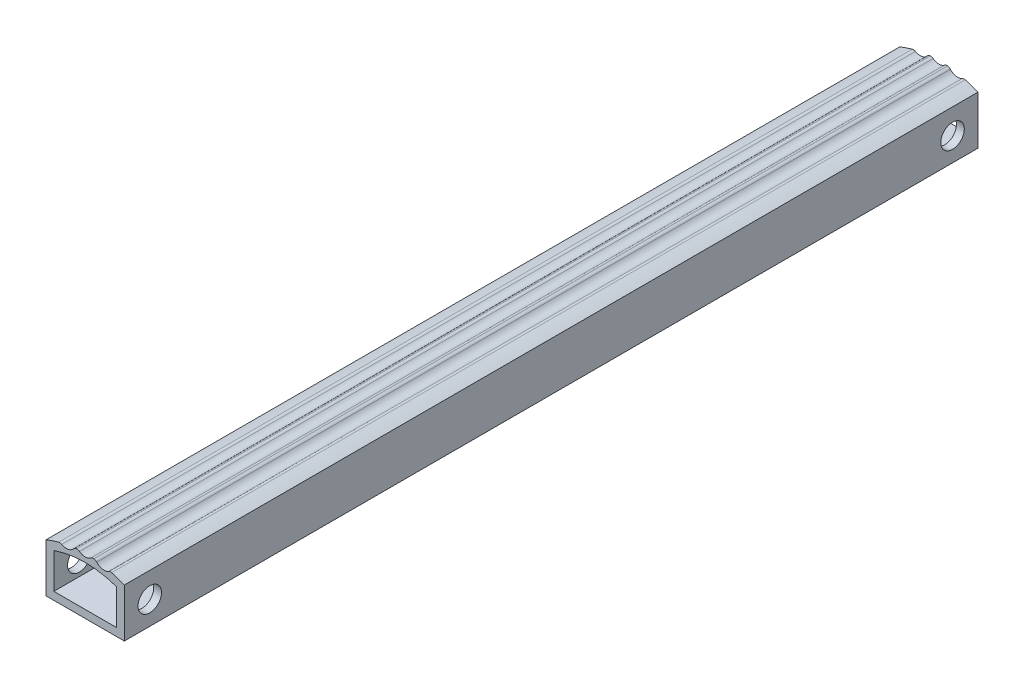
ISO-10303-21;
HEADER;
FILE_DESCRIPTION(('STEP AP214'),'2;1');
FILE_NAME('part.step','',(''),(''),'','','');
FILE_SCHEMA(('AUTOMOTIVE_DESIGN { 1 0 10303 214 1 1 1 1 }'));
ENDSEC;
DATA;
#1=APPLICATION_CONTEXT('core data for automotive mechanical design processes');
#2=APPLICATION_PROTOCOL_DEFINITION('international standard','automotive_design',2000,#1);
#3=PRODUCT_CONTEXT('',#1,'mechanical');
#4=PRODUCT('Part','Part','',(#3));
#5=PRODUCT_RELATED_PRODUCT_CATEGORY('part','',(#4));
#6=PRODUCT_DEFINITION_FORMATION('','',#4);
#7=PRODUCT_DEFINITION_CONTEXT('part definition',#1,'design');
#8=PRODUCT_DEFINITION('design','',#6,#7);
#9=PRODUCT_DEFINITION_SHAPE('','',#8);
#10=(LENGTH_UNIT() NAMED_UNIT(*) SI_UNIT(.MILLI.,.METRE.));
#11=(NAMED_UNIT(*) PLANE_ANGLE_UNIT() SI_UNIT($,.RADIAN.));
#12=(NAMED_UNIT(*) SI_UNIT($,.STERADIAN.) SOLID_ANGLE_UNIT());
#13=UNCERTAINTY_MEASURE_WITH_UNIT(LENGTH_MEASURE(1.E-05),#10,'distance_accuracy_value','');
#14=(GEOMETRIC_REPRESENTATION_CONTEXT(3) GLOBAL_UNCERTAINTY_ASSIGNED_CONTEXT((#13)) GLOBAL_UNIT_ASSIGNED_CONTEXT((#10,
#11,#12)) REPRESENTATION_CONTEXT('',''));
#15=CARTESIAN_POINT('',(0.,0.,0.));
#16=DIRECTION('',(0.,0.,1.));
#17=DIRECTION('',(1.,0.,0.));
#18=AXIS2_PLACEMENT_3D('',#15,#16,#17);
#19=CARTESIAN_POINT('',(0.,-5.8,54.5));
#20=DIRECTION('',(0.,0.,1.));
#21=DIRECTION('',(1.,0.,0.));
#22=AXIS2_PLACEMENT_3D('',#19,#20,#21);
#23=PLANE('',#22);
#24=DIRECTION('',(0.,-1.,0.));
#25=VECTOR('',#24,1.);
#26=CARTESIAN_POINT('',(-5.,0.,54.5));
#27=LINE('',#26,#25);
#28=CARTESIAN_POINT('',(-5.,6.2,54.5));
#29=VERTEX_POINT('',#28);
#30=CARTESIAN_POINT('',(-5.,0.,54.5));
#31=VERTEX_POINT('',#30);
#32=EDGE_CURVE('E212',#29,#31,#27,.T.);
#33=ORIENTED_EDGE('',*,*,#32,.T.);
#34=DIRECTION('',(1.,0.,0.));
#35=VECTOR('',#34,1.);
#36=CARTESIAN_POINT('',(-5.,0.,54.5));
#37=LINE('',#36,#35);
#38=CARTESIAN_POINT('',(5.,0.,54.5));
#39=VERTEX_POINT('',#38);
#40=EDGE_CURVE('E215',#31,#39,#37,.T.);
#41=ORIENTED_EDGE('',*,*,#40,.T.);
#42=DIRECTION('',(0.,1.,0.));
#43=VECTOR('',#42,1.);
#44=CARTESIAN_POINT('',(5.,0.,54.5));
#45=LINE('',#44,#43);
#46=CARTESIAN_POINT('',(5.,6.2,54.5));
#47=VERTEX_POINT('',#46);
#48=EDGE_CURVE('E218',#39,#47,#45,.T.);
#49=ORIENTED_EDGE('',*,*,#48,.T.);
#50=CARTESIAN_POINT('',(0.,-5.8,54.5));
#51=DIRECTION('',(0.,0.,1.));
#52=DIRECTION('',(1.,0.,0.));
#53=AXIS2_PLACEMENT_3D('',#50,#51,#52);
#54=CIRCLE('',#53,13.);
#55=CARTESIAN_POINT('',(3.37851103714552,6.75331283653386,54.5));
#56=VERTEX_POINT('',#55);
#57=EDGE_CURVE('E220',#47,#56,#54,.T.);
#58=ORIENTED_EDGE('',*,*,#57,.T.);
#59=CARTESIAN_POINT('',(3.24856830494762,6.27049311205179,54.5));
#60=DIRECTION('',(0.,0.,1.));
#61=DIRECTION('',(-1.,0.,0.));
#62=AXIS2_PLACEMENT_3D('',#59,#60,#61);
#63=CIRCLE('',#62,0.5);
#64=CARTESIAN_POINT('',(2.99745317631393,6.70286007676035,54.5));
#65=VERTEX_POINT('',#64);
#66=EDGE_CURVE('E222',#56,#65,#63,.T.);
#67=ORIENTED_EDGE('',*,*,#66,.T.);
#68=CARTESIAN_POINT('',(2.39477686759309,7.74054079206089,54.5));
#69=DIRECTION('',(0.,0.,-1.));
#70=DIRECTION('',(1.,0.,0.));
#71=AXIS2_PLACEMENT_3D('',#68,#69,#70);
#72=CIRCLE('',#71,1.20000000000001);
#73=CARTESIAN_POINT('',(1.47274455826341,6.9725196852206,54.5));
#74=VERTEX_POINT('',#73);
#75=EDGE_CURVE('E224',#65,#74,#72,.T.);
#76=ORIENTED_EDGE('',*,*,#75,.T.);
#77=CARTESIAN_POINT('',(1.08856442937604,6.65251089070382,54.5));
#78=DIRECTION('',(0.,0.,1.));
#79=DIRECTION('',(1.,0.,0.));
#80=AXIS2_PLACEMENT_3D('',#77,#78,#79);
#81=CIRCLE('',#80,0.5);
#82=CARTESIAN_POINT('',(1.13210700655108,7.15061132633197,54.5));
#83=VERTEX_POINT('',#82);
#84=EDGE_CURVE('E226',#74,#83,#81,.T.);
#85=ORIENTED_EDGE('',*,*,#84,.T.);
#86=CARTESIAN_POINT('',(0.,-5.8,54.5));
#87=DIRECTION('',(0.,0.,1.));
#88=DIRECTION('',(1.,0.,0.));
#89=AXIS2_PLACEMENT_3D('',#86,#87,#88);
#90=CIRCLE('',#89,13.);
#91=CARTESIAN_POINT('',(1.08333169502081,7.15478260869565,54.5));
#92=VERTEX_POINT('',#91);
#93=EDGE_CURVE('E228',#83,#92,#90,.T.);
#94=ORIENTED_EDGE('',*,*,#93,.T.);
#95=CARTESIAN_POINT('',(1.04166509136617,6.65652173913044,54.5));
#96=DIRECTION('',(0.,0.,1.));
#97=DIRECTION('',(-1.,0.,0.));
#98=AXIS2_PLACEMENT_3D('',#95,#96,#97);
#99=CIRCLE('',#98,0.5);
#100=CARTESIAN_POINT('',(0.735293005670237,7.05166240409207,54.5));
#101=VERTEX_POINT('',#100);
#102=EDGE_CURVE('E230',#92,#101,#99,.T.);
#103=ORIENTED_EDGE('',*,*,#102,.T.);
#104=CARTESIAN_POINT('',(0.,8.,54.5));
#105=DIRECTION('',(0.,0.,-1.));
#106=DIRECTION('',(1.,0.,0.));
#107=AXIS2_PLACEMENT_3D('',#104,#105,#106);
#108=CIRCLE('',#107,1.2);
#109=CARTESIAN_POINT('',(-0.735293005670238,7.05166240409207,54.5));
#110=VERTEX_POINT('',#109);
#111=EDGE_CURVE('E232',#101,#110,#108,.T.);
#112=ORIENTED_EDGE('',*,*,#111,.T.);
#113=CARTESIAN_POINT('',(-1.04166509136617,6.65652173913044,54.5));
#114=DIRECTION('',(0.,0.,1.));
#115=DIRECTION('',(1.,0.,0.));
#116=AXIS2_PLACEMENT_3D('',#113,#114,#115);
#117=CIRCLE('',#116,0.5);
#118=CARTESIAN_POINT('',(-1.08333169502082,7.15478260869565,54.5));
#119=VERTEX_POINT('',#118);
#120=EDGE_CURVE('E234',#110,#119,#117,.T.);
#121=ORIENTED_EDGE('',*,*,#120,.T.);
#122=CARTESIAN_POINT('',(0.,-5.8,54.5));
#123=DIRECTION('',(0.,0.,1.));
#124=DIRECTION('',(1.,0.,0.));
#125=AXIS2_PLACEMENT_3D('',#122,#123,#124);
#126=CIRCLE('',#125,13.);
#127=CARTESIAN_POINT('',(-1.13210700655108,7.15061132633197,54.5));
#128=VERTEX_POINT('',#127);
#129=EDGE_CURVE('E236',#119,#128,#126,.T.);
#130=ORIENTED_EDGE('',*,*,#129,.T.);
#131=CARTESIAN_POINT('',(-1.08856442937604,6.65251089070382,54.5));
#132=DIRECTION('',(0.,0.,1.));
#133=DIRECTION('',(-1.,0.,0.));
#134=AXIS2_PLACEMENT_3D('',#131,#132,#133);
#135=CIRCLE('',#134,0.5);
#136=CARTESIAN_POINT('',(-1.47274455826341,6.9725196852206,54.5));
#137=VERTEX_POINT('',#136);
#138=EDGE_CURVE('E238',#128,#137,#135,.T.);
#139=ORIENTED_EDGE('',*,*,#138,.T.);
#140=CARTESIAN_POINT('',(-2.39477686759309,7.74054079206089,54.5));
#141=DIRECTION('',(0.,0.,-1.));
#142=DIRECTION('',(-1.,0.,0.));
#143=AXIS2_PLACEMENT_3D('',#140,#141,#142);
#144=CIRCLE('',#143,1.20000000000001);
#145=CARTESIAN_POINT('',(-2.99745317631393,6.70286007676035,54.5));
#146=VERTEX_POINT('',#145);
#147=EDGE_CURVE('E240',#137,#146,#144,.T.);
#148=ORIENTED_EDGE('',*,*,#147,.T.);
#149=CARTESIAN_POINT('',(-3.24856830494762,6.27049311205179,54.5));
#150=DIRECTION('',(0.,0.,1.));
#151=DIRECTION('',(1.,0.,0.));
#152=AXIS2_PLACEMENT_3D('',#149,#150,#151);
#153=CIRCLE('',#152,0.5);
#154=CARTESIAN_POINT('',(-3.37851103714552,6.75331283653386,54.5));
#155=VERTEX_POINT('',#154);
#156=EDGE_CURVE('E242',#146,#155,#153,.T.);
#157=ORIENTED_EDGE('',*,*,#156,.T.);
#158=CARTESIAN_POINT('',(0.,-5.8,54.5));
#159=DIRECTION('',(0.,0.,1.));
#160=DIRECTION('',(1.,0.,0.));
#161=AXIS2_PLACEMENT_3D('',#158,#159,#160);
#162=CIRCLE('',#161,13.);
#163=EDGE_CURVE('E244',#155,#29,#162,.T.);
#164=ORIENTED_EDGE('',*,*,#163,.T.);
#165=EDGE_LOOP('',(#33,#41,#49,#58,#67,#76,#85,#94,#103,#112,#121,#130,#139,#148,#157,#164));
#166=FACE_BOUND('',#165,.T.);
#167=DIRECTION('',(0.,1.,0.));
#168=VECTOR('',#167,1.);
#169=CARTESIAN_POINT('',(4.,1.,54.5));
#170=LINE('',#169,#168);
#171=CARTESIAN_POINT('',(4.,1.,54.5));
#172=VERTEX_POINT('',#171);
#173=CARTESIAN_POINT('',(4.,5.51370849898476,54.5));
#174=VERTEX_POINT('',#173);
#175=EDGE_CURVE('E182',#172,#174,#170,.T.);
#176=ORIENTED_EDGE('',*,*,#175,.F.);
#177=DIRECTION('',(1.,0.,0.));
#178=VECTOR('',#177,1.);
#179=CARTESIAN_POINT('',(-4.,1.,54.5));
#180=LINE('',#179,#178);
#181=CARTESIAN_POINT('',(-4.,1.,54.5));
#182=VERTEX_POINT('',#181);
#183=EDGE_CURVE('E174',#182,#172,#180,.T.);
#184=ORIENTED_EDGE('',*,*,#183,.F.);
#185=DIRECTION('',(0.,-1.,0.));
#186=VECTOR('',#185,1.);
#187=CARTESIAN_POINT('',(-4.,1.,54.5));
#188=LINE('',#187,#186);
#189=CARTESIAN_POINT('',(-4.,5.51370849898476,54.5));
#190=VERTEX_POINT('',#189);
#191=EDGE_CURVE('E196',#190,#182,#188,.T.);
#192=ORIENTED_EDGE('',*,*,#191,.F.);
#193=CARTESIAN_POINT('',(0.,-5.8,54.5));
#194=DIRECTION('',(0.,0.,1.));
#195=DIRECTION('',(1.,0.,0.));
#196=AXIS2_PLACEMENT_3D('',#193,#194,#195);
#197=CIRCLE('',#196,12.);
#198=EDGE_CURVE('E194',#174,#190,#197,.T.);
#199=ORIENTED_EDGE('',*,*,#198,.F.);
#200=EDGE_LOOP('',(#176,#184,#192,#199));
#201=FACE_BOUND('',#200,.T.);
#202=ADVANCED_FACE('F35',(#166,#201),#23,.T.);
#203=CARTESIAN_POINT('',(0.,-5.8,-54.5));
#204=DIRECTION('',(0.,0.,1.));
#205=DIRECTION('',(1.,0.,0.));
#206=AXIS2_PLACEMENT_3D('',#203,#204,#205);
#207=PLANE('',#206);
#208=DIRECTION('',(0.,-1.,0.));
#209=VECTOR('',#208,1.);
#210=CARTESIAN_POINT('',(-5.,0.,-54.5));
#211=LINE('',#210,#209);
#212=CARTESIAN_POINT('',(-5.,6.2,-54.5));
#213=VERTEX_POINT('',#212);
#214=CARTESIAN_POINT('',(-5.,0.,-54.5));
#215=VERTEX_POINT('',#214);
#216=EDGE_CURVE('E190',#213,#215,#211,.T.);
#217=ORIENTED_EDGE('',*,*,#216,.F.);
#218=CARTESIAN_POINT('',(0.,-5.8,-54.5));
#219=DIRECTION('',(0.,0.,1.));
#220=DIRECTION('',(1.,0.,0.));
#221=AXIS2_PLACEMENT_3D('',#218,#219,#220);
#222=CIRCLE('',#221,13.);
#223=CARTESIAN_POINT('',(-3.37851103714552,6.75331283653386,-54.5));
#224=VERTEX_POINT('',#223);
#225=EDGE_CURVE('E216',#224,#213,#222,.T.);
#226=ORIENTED_EDGE('',*,*,#225,.F.);
#227=CARTESIAN_POINT('',(-3.24856830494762,6.27049311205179,-54.5));
#228=DIRECTION('',(0.,0.,1.));
#229=DIRECTION('',(1.,0.,0.));
#230=AXIS2_PLACEMENT_3D('',#227,#228,#229);
#231=CIRCLE('',#230,0.5);
#232=CARTESIAN_POINT('',(-2.99745317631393,6.70286007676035,-54.5));
#233=VERTEX_POINT('',#232);
#234=EDGE_CURVE('E275',#233,#224,#231,.T.);
#235=ORIENTED_EDGE('',*,*,#234,.F.);
#236=CARTESIAN_POINT('',(-2.39477686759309,7.74054079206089,-54.5));
#237=DIRECTION('',(0.,0.,-1.));
#238=DIRECTION('',(-1.,0.,0.));
#239=AXIS2_PLACEMENT_3D('',#236,#237,#238);
#240=CIRCLE('',#239,1.20000000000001);
#241=CARTESIAN_POINT('',(-1.47274455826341,6.9725196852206,-54.5));
#242=VERTEX_POINT('',#241);
#243=EDGE_CURVE('E273',#242,#233,#240,.T.);
#244=ORIENTED_EDGE('',*,*,#243,.F.);
#245=CARTESIAN_POINT('',(-1.08856442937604,6.65251089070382,-54.5));
#246=DIRECTION('',(0.,0.,1.));
#247=DIRECTION('',(-1.,0.,0.));
#248=AXIS2_PLACEMENT_3D('',#245,#246,#247);
#249=CIRCLE('',#248,0.5);
#250=CARTESIAN_POINT('',(-1.13210700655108,7.15061132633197,-54.5));
#251=VERTEX_POINT('',#250);
#252=EDGE_CURVE('E271',#251,#242,#249,.T.);
#253=ORIENTED_EDGE('',*,*,#252,.F.);
#254=CARTESIAN_POINT('',(0.,-5.8,-54.5));
#255=DIRECTION('',(0.,0.,1.));
#256=DIRECTION('',(1.,0.,0.));
#257=AXIS2_PLACEMENT_3D('',#254,#255,#256);
#258=CIRCLE('',#257,13.);
#259=CARTESIAN_POINT('',(-1.08333169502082,7.15478260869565,-54.5));
#260=VERTEX_POINT('',#259);
#261=EDGE_CURVE('E269',#260,#251,#258,.T.);
#262=ORIENTED_EDGE('',*,*,#261,.F.);
#263=CARTESIAN_POINT('',(-1.04166509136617,6.65652173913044,-54.5));
#264=DIRECTION('',(0.,0.,1.));
#265=DIRECTION('',(1.,0.,0.));
#266=AXIS2_PLACEMENT_3D('',#263,#264,#265);
#267=CIRCLE('',#266,0.5);
#268=CARTESIAN_POINT('',(-0.735293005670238,7.05166240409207,-54.5));
#269=VERTEX_POINT('',#268);
#270=EDGE_CURVE('E267',#269,#260,#267,.T.);
#271=ORIENTED_EDGE('',*,*,#270,.F.);
#272=CARTESIAN_POINT('',(0.,8.,-54.5));
#273=DIRECTION('',(0.,0.,-1.));
#274=DIRECTION('',(1.,0.,0.));
#275=AXIS2_PLACEMENT_3D('',#272,#273,#274);
#276=CIRCLE('',#275,1.2);
#277=CARTESIAN_POINT('',(0.735293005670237,7.05166240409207,-54.5));
#278=VERTEX_POINT('',#277);
#279=EDGE_CURVE('E265',#278,#269,#276,.T.);
#280=ORIENTED_EDGE('',*,*,#279,.F.);
#281=CARTESIAN_POINT('',(1.04166509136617,6.65652173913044,-54.5));
#282=DIRECTION('',(0.,0.,1.));
#283=DIRECTION('',(-1.,0.,0.));
#284=AXIS2_PLACEMENT_3D('',#281,#282,#283);
#285=CIRCLE('',#284,0.5);
#286=CARTESIAN_POINT('',(1.08333169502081,7.15478260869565,-54.5));
#287=VERTEX_POINT('',#286);
#288=EDGE_CURVE('E263',#287,#278,#285,.T.);
#289=ORIENTED_EDGE('',*,*,#288,.F.);
#290=CARTESIAN_POINT('',(0.,-5.8,-54.5));
#291=DIRECTION('',(0.,0.,1.));
#292=DIRECTION('',(1.,0.,0.));
#293=AXIS2_PLACEMENT_3D('',#290,#291,#292);
#294=CIRCLE('',#293,13.);
#295=CARTESIAN_POINT('',(1.13210700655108,7.15061132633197,-54.5));
#296=VERTEX_POINT('',#295);
#297=EDGE_CURVE('E261',#296,#287,#294,.T.);
#298=ORIENTED_EDGE('',*,*,#297,.F.);
#299=CARTESIAN_POINT('',(1.08856442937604,6.65251089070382,-54.5));
#300=DIRECTION('',(0.,0.,1.));
#301=DIRECTION('',(1.,0.,0.));
#302=AXIS2_PLACEMENT_3D('',#299,#300,#301);
#303=CIRCLE('',#302,0.5);
#304=CARTESIAN_POINT('',(1.47274455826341,6.9725196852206,-54.5));
#305=VERTEX_POINT('',#304);
#306=EDGE_CURVE('E259',#305,#296,#303,.T.);
#307=ORIENTED_EDGE('',*,*,#306,.F.);
#308=CARTESIAN_POINT('',(2.39477686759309,7.74054079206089,-54.5));
#309=DIRECTION('',(0.,0.,-1.));
#310=DIRECTION('',(1.,0.,0.));
#311=AXIS2_PLACEMENT_3D('',#308,#309,#310);
#312=CIRCLE('',#311,1.20000000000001);
#313=CARTESIAN_POINT('',(2.99745317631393,6.70286007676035,-54.5));
#314=VERTEX_POINT('',#313);
#315=EDGE_CURVE('E257',#314,#305,#312,.T.);
#316=ORIENTED_EDGE('',*,*,#315,.F.);
#317=CARTESIAN_POINT('',(3.24856830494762,6.27049311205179,-54.5));
#318=DIRECTION('',(0.,0.,1.));
#319=DIRECTION('',(-1.,0.,0.));
#320=AXIS2_PLACEMENT_3D('',#317,#318,#319);
#321=CIRCLE('',#320,0.5);
#322=CARTESIAN_POINT('',(3.37851103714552,6.75331283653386,-54.5));
#323=VERTEX_POINT('',#322);
#324=EDGE_CURVE('E255',#323,#314,#321,.T.);
#325=ORIENTED_EDGE('',*,*,#324,.F.);
#326=CARTESIAN_POINT('',(0.,-5.8,-54.5));
#327=DIRECTION('',(0.,0.,1.));
#328=DIRECTION('',(1.,0.,0.));
#329=AXIS2_PLACEMENT_3D('',#326,#327,#328);
#330=CIRCLE('',#329,13.);
#331=CARTESIAN_POINT('',(5.,6.2,-54.5));
#332=VERTEX_POINT('',#331);
#333=EDGE_CURVE('E253',#332,#323,#330,.T.);
#334=ORIENTED_EDGE('',*,*,#333,.F.);
#335=DIRECTION('',(0.,1.,0.));
#336=VECTOR('',#335,1.);
#337=CARTESIAN_POINT('',(5.,0.,-54.5));
#338=LINE('',#337,#336);
#339=CARTESIAN_POINT('',(5.,0.,-54.5));
#340=VERTEX_POINT('',#339);
#341=EDGE_CURVE('E251',#340,#332,#338,.T.);
#342=ORIENTED_EDGE('',*,*,#341,.F.);
#343=DIRECTION('',(1.,0.,0.));
#344=VECTOR('',#343,1.);
#345=CARTESIAN_POINT('',(-5.,0.,-54.5));
#346=LINE('',#345,#344);
#347=EDGE_CURVE('E249',#215,#340,#346,.T.);
#348=ORIENTED_EDGE('',*,*,#347,.F.);
#349=EDGE_LOOP('',(#217,#226,#235,#244,#253,#262,#271,#280,#289,#298,#307,#316,#325,#334,#342,#348));
#350=FACE_BOUND('',#349,.T.);
#351=DIRECTION('',(1.,0.,0.));
#352=VECTOR('',#351,1.);
#353=CARTESIAN_POINT('',(-4.,1.,-54.5));
#354=LINE('',#353,#352);
#355=CARTESIAN_POINT('',(-4.,1.,-54.5));
#356=VERTEX_POINT('',#355);
#357=CARTESIAN_POINT('',(4.,1.,-54.5));
#358=VERTEX_POINT('',#357);
#359=EDGE_CURVE('E60',#356,#358,#354,.T.);
#360=ORIENTED_EDGE('',*,*,#359,.T.);
#361=DIRECTION('',(0.,1.,0.));
#362=VECTOR('',#361,1.);
#363=CARTESIAN_POINT('',(4.,1.,-54.5));
#364=LINE('',#363,#362);
#365=CARTESIAN_POINT('',(4.,5.51370849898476,-54.5));
#366=VERTEX_POINT('',#365);
#367=EDGE_CURVE('E189',#358,#366,#364,.T.);
#368=ORIENTED_EDGE('',*,*,#367,.T.);
#369=CARTESIAN_POINT('',(0.,-5.8,-54.5));
#370=DIRECTION('',(0.,0.,1.));
#371=DIRECTION('',(1.,0.,0.));
#372=AXIS2_PLACEMENT_3D('',#369,#370,#371);
#373=CIRCLE('',#372,12.);
#374=CARTESIAN_POINT('',(-4.,5.51370849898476,-54.5));
#375=VERTEX_POINT('',#374);
#376=EDGE_CURVE('E204',#366,#375,#373,.T.);
#377=ORIENTED_EDGE('',*,*,#376,.T.);
#378=DIRECTION('',(0.,-1.,0.));
#379=VECTOR('',#378,1.);
#380=CARTESIAN_POINT('',(-4.,1.,-54.5));
#381=LINE('',#380,#379);
#382=EDGE_CURVE('E183',#375,#356,#381,.T.);
#383=ORIENTED_EDGE('',*,*,#382,.T.);
#384=EDGE_LOOP('',(#360,#368,#377,#383));
#385=FACE_BOUND('',#384,.T.);
#386=ADVANCED_FACE('F358',(#350,#385),#207,.F.);
#387=CARTESIAN_POINT('',(-5.,0.,54.5));
#388=DIRECTION('',(1.,0.,0.));
#389=DIRECTION('',(0.,0.,-1.));
#390=AXIS2_PLACEMENT_3D('',#387,#388,#389);
#391=PLANE('',#390);
#392=CARTESIAN_POINT('',(-5.,3.00000000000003,51.25));
#393=DIRECTION('',(-1.,0.,0.));
#394=DIRECTION('',(0.,0.,1.));
#395=AXIS2_PLACEMENT_3D('',#392,#393,#394);
#396=CIRCLE('',#395,1.5);
#397=CARTESIAN_POINT('',(-5.,3.00000000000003,52.75));
#398=VERTEX_POINT('',#397);
#399=EDGE_CURVE('E337',#398,#398,#396,.T.);
#400=ORIENTED_EDGE('',*,*,#399,.F.);
#401=EDGE_LOOP('',(#400));
#402=FACE_BOUND('',#401,.T.);
#403=CARTESIAN_POINT('',(-5.,3.,-51.25));
#404=DIRECTION('',(-1.,0.,0.));
#405=DIRECTION('',(0.,0.,1.));
#406=AXIS2_PLACEMENT_3D('',#403,#404,#405);
#407=CIRCLE('',#406,1.5);
#408=CARTESIAN_POINT('',(-5.,3.,-49.75));
#409=VERTEX_POINT('',#408);
#410=EDGE_CURVE('E327',#409,#409,#407,.T.);
#411=ORIENTED_EDGE('',*,*,#410,.F.);
#412=EDGE_LOOP('',(#411));
#413=FACE_BOUND('',#412,.T.);
#414=ORIENTED_EDGE('',*,*,#216,.T.);
#415=DIRECTION('',(0.,0.,-1.));
#416=VECTOR('',#415,1.);
#417=CARTESIAN_POINT('',(-5.,0.,54.5));
#418=LINE('',#417,#416);
#419=EDGE_CURVE('E11',#31,#215,#418,.T.);
#420=ORIENTED_EDGE('',*,*,#419,.F.);
#421=ORIENTED_EDGE('',*,*,#32,.F.);
#422=DIRECTION('',(0.,0.,-1.));
#423=VECTOR('',#422,1.);
#424=CARTESIAN_POINT('',(-5.,6.2,54.5));
#425=LINE('',#424,#423);
#426=EDGE_CURVE('E246',#29,#213,#425,.T.);
#427=ORIENTED_EDGE('',*,*,#426,.T.);
#428=EDGE_LOOP('',(#414,#420,#421,#427));
#429=FACE_BOUND('',#428,.T.);
#430=ADVANCED_FACE('F37',(#402,#413,#429),#391,.F.);
#431=CARTESIAN_POINT('',(-5.,0.,54.5));
#432=DIRECTION('',(0.,1.,0.));
#433=DIRECTION('',(0.,0.,1.));
#434=AXIS2_PLACEMENT_3D('',#431,#432,#433);
#435=PLANE('',#434);
#436=ORIENTED_EDGE('',*,*,#347,.T.);
#437=DIRECTION('',(0.,0.,-1.));
#438=VECTOR('',#437,1.);
#439=CARTESIAN_POINT('',(5.,0.,54.5));
#440=LINE('',#439,#438);
#441=EDGE_CURVE('E44',#39,#340,#440,.T.);
#442=ORIENTED_EDGE('',*,*,#441,.F.);
#443=ORIENTED_EDGE('',*,*,#40,.F.);
#444=ORIENTED_EDGE('',*,*,#419,.T.);
#445=EDGE_LOOP('',(#436,#442,#443,#444));
#446=FACE_BOUND('',#445,.T.);
#447=ADVANCED_FACE('F431',(#446),#435,.F.);
#448=CARTESIAN_POINT('',(5.,0.,54.5));
#449=DIRECTION('',(-1.,0.,0.));
#450=DIRECTION('',(0.,0.,1.));
#451=AXIS2_PLACEMENT_3D('',#448,#449,#450);
#452=PLANE('',#451);
#453=CARTESIAN_POINT('',(5.,3.00000000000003,51.25));
#454=DIRECTION('',(-1.,0.,0.));
#455=DIRECTION('',(0.,0.,1.));
#456=AXIS2_PLACEMENT_3D('',#453,#454,#455);
#457=CIRCLE('',#456,1.5);
#458=CARTESIAN_POINT('',(5.,3.00000000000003,52.75));
#459=VERTEX_POINT('',#458);
#460=EDGE_CURVE('E340',#459,#459,#457,.T.);
#461=ORIENTED_EDGE('',*,*,#460,.T.);
#462=EDGE_LOOP('',(#461));
#463=FACE_BOUND('',#462,.T.);
#464=CARTESIAN_POINT('',(5.,3.,-51.25));
#465=DIRECTION('',(-1.,0.,0.));
#466=DIRECTION('',(0.,0.,1.));
#467=AXIS2_PLACEMENT_3D('',#464,#465,#466);
#468=CIRCLE('',#467,1.5);
#469=CARTESIAN_POINT('',(5.,3.,-49.75));
#470=VERTEX_POINT('',#469);
#471=EDGE_CURVE('E322',#470,#470,#468,.T.);
#472=ORIENTED_EDGE('',*,*,#471,.T.);
#473=EDGE_LOOP('',(#472));
#474=FACE_BOUND('',#473,.T.);
#475=ORIENTED_EDGE('',*,*,#341,.T.);
#476=DIRECTION('',(0.,0.,-1.));
#477=VECTOR('',#476,1.);
#478=CARTESIAN_POINT('',(5.,6.2,54.5));
#479=LINE('',#478,#477);
#480=EDGE_CURVE('E316',#47,#332,#479,.T.);
#481=ORIENTED_EDGE('',*,*,#480,.F.);
#482=ORIENTED_EDGE('',*,*,#48,.F.);
#483=ORIENTED_EDGE('',*,*,#441,.T.);
#484=EDGE_LOOP('',(#475,#481,#482,#483));
#485=FACE_BOUND('',#484,.T.);
#486=ADVANCED_FACE('F428',(#463,#474,#485),#452,.F.);
#487=CARTESIAN_POINT('',(0.,-5.8,54.5));
#488=DIRECTION('',(0.,0.,-1.));
#489=DIRECTION('',(-1.,0.,0.));
#490=AXIS2_PLACEMENT_3D('',#487,#488,#489);
#491=CYLINDRICAL_SURFACE('',#490,13.);
#492=ORIENTED_EDGE('',*,*,#333,.T.);
#493=DIRECTION('',(0.,0.,-1.));
#494=VECTOR('',#493,1.);
#495=CARTESIAN_POINT('',(3.37851103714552,6.75331283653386,54.5));
#496=LINE('',#495,#494);
#497=EDGE_CURVE('E313',#56,#323,#496,.T.);
#498=ORIENTED_EDGE('',*,*,#497,.F.);
#499=ORIENTED_EDGE('',*,*,#57,.F.);
#500=ORIENTED_EDGE('',*,*,#480,.T.);
#501=EDGE_LOOP('',(#492,#498,#499,#500));
#502=FACE_BOUND('',#501,.T.);
#503=ADVANCED_FACE('F424',(#502),#491,.T.);
#504=CARTESIAN_POINT('',(3.24856830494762,6.27049311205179,54.5));
#505=DIRECTION('',(0.,0.,-1.));
#506=DIRECTION('',(-1.,0.,0.));
#507=AXIS2_PLACEMENT_3D('',#504,#505,#506);
#508=CYLINDRICAL_SURFACE('',#507,0.5);
#509=ORIENTED_EDGE('',*,*,#324,.T.);
#510=DIRECTION('',(0.,0.,-1.));
#511=VECTOR('',#510,1.);
#512=CARTESIAN_POINT('',(2.99745317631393,6.70286007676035,54.5));
#513=LINE('',#512,#511);
#514=EDGE_CURVE('E310',#65,#314,#513,.T.);
#515=ORIENTED_EDGE('',*,*,#514,.F.);
#516=ORIENTED_EDGE('',*,*,#66,.F.);
#517=ORIENTED_EDGE('',*,*,#497,.T.);
#518=EDGE_LOOP('',(#509,#515,#516,#517));
#519=FACE_BOUND('',#518,.T.);
#520=ADVANCED_FACE('F420',(#519),#508,.T.);
#521=CARTESIAN_POINT('',(2.39477686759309,7.74054079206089,54.5));
#522=DIRECTION('',(0.,0.,-1.));
#523=DIRECTION('',(-1.,0.,0.));
#524=AXIS2_PLACEMENT_3D('',#521,#522,#523);
#525=CYLINDRICAL_SURFACE('',#524,1.20000000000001);
#526=ORIENTED_EDGE('',*,*,#315,.T.);
#527=DIRECTION('',(0.,0.,-1.));
#528=VECTOR('',#527,1.);
#529=CARTESIAN_POINT('',(1.47274455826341,6.9725196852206,54.5));
#530=LINE('',#529,#528);
#531=EDGE_CURVE('E307',#74,#305,#530,.T.);
#532=ORIENTED_EDGE('',*,*,#531,.F.);
#533=ORIENTED_EDGE('',*,*,#75,.F.);
#534=ORIENTED_EDGE('',*,*,#514,.T.);
#535=EDGE_LOOP('',(#526,#532,#533,#534));
#536=FACE_BOUND('',#535,.T.);
#537=ADVANCED_FACE('F416',(#536),#525,.F.);
#538=CARTESIAN_POINT('',(1.08856442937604,6.65251089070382,54.5));
#539=DIRECTION('',(0.,0.,-1.));
#540=DIRECTION('',(-1.,0.,0.));
#541=AXIS2_PLACEMENT_3D('',#538,#539,#540);
#542=CYLINDRICAL_SURFACE('',#541,0.5);
#543=ORIENTED_EDGE('',*,*,#306,.T.);
#544=DIRECTION('',(0.,0.,-1.));
#545=VECTOR('',#544,1.);
#546=CARTESIAN_POINT('',(1.13210700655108,7.15061132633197,54.5));
#547=LINE('',#546,#545);
#548=EDGE_CURVE('E304',#83,#296,#547,.T.);
#549=ORIENTED_EDGE('',*,*,#548,.F.);
#550=ORIENTED_EDGE('',*,*,#84,.F.);
#551=ORIENTED_EDGE('',*,*,#531,.T.);
#552=EDGE_LOOP('',(#543,#549,#550,#551));
#553=FACE_BOUND('',#552,.T.);
#554=ADVANCED_FACE('F412',(#553),#542,.T.);
#555=CARTESIAN_POINT('',(0.,-5.8,54.5));
#556=DIRECTION('',(0.,0.,-1.));
#557=DIRECTION('',(-1.,0.,0.));
#558=AXIS2_PLACEMENT_3D('',#555,#556,#557);
#559=CYLINDRICAL_SURFACE('',#558,13.);
#560=ORIENTED_EDGE('',*,*,#297,.T.);
#561=DIRECTION('',(0.,0.,-1.));
#562=VECTOR('',#561,1.);
#563=CARTESIAN_POINT('',(1.08333169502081,7.15478260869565,54.5));
#564=LINE('',#563,#562);
#565=EDGE_CURVE('E301',#92,#287,#564,.T.);
#566=ORIENTED_EDGE('',*,*,#565,.F.);
#567=ORIENTED_EDGE('',*,*,#93,.F.);
#568=ORIENTED_EDGE('',*,*,#548,.T.);
#569=EDGE_LOOP('',(#560,#566,#567,#568));
#570=FACE_BOUND('',#569,.T.);
#571=ADVANCED_FACE('F408',(#570),#559,.T.);
#572=CARTESIAN_POINT('',(1.04166509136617,6.65652173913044,54.5));
#573=DIRECTION('',(0.,0.,-1.));
#574=DIRECTION('',(-1.,0.,0.));
#575=AXIS2_PLACEMENT_3D('',#572,#573,#574);
#576=CYLINDRICAL_SURFACE('',#575,0.5);
#577=ORIENTED_EDGE('',*,*,#288,.T.);
#578=DIRECTION('',(0.,0.,-1.));
#579=VECTOR('',#578,1.);
#580=CARTESIAN_POINT('',(0.735293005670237,7.05166240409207,54.5));
#581=LINE('',#580,#579);
#582=EDGE_CURVE('E298',#101,#278,#581,.T.);
#583=ORIENTED_EDGE('',*,*,#582,.F.);
#584=ORIENTED_EDGE('',*,*,#102,.F.);
#585=ORIENTED_EDGE('',*,*,#565,.T.);
#586=EDGE_LOOP('',(#577,#583,#584,#585));
#587=FACE_BOUND('',#586,.T.);
#588=ADVANCED_FACE('F404',(#587),#576,.T.);
#589=CARTESIAN_POINT('',(0.,8.,54.5));
#590=DIRECTION('',(0.,0.,-1.));
#591=DIRECTION('',(-1.,0.,0.));
#592=AXIS2_PLACEMENT_3D('',#589,#590,#591);
#593=CYLINDRICAL_SURFACE('',#592,1.2);
#594=ORIENTED_EDGE('',*,*,#279,.T.);
#595=DIRECTION('',(0.,0.,-1.));
#596=VECTOR('',#595,1.);
#597=CARTESIAN_POINT('',(-0.735293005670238,7.05166240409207,54.5));
#598=LINE('',#597,#596);
#599=EDGE_CURVE('E295',#110,#269,#598,.T.);
#600=ORIENTED_EDGE('',*,*,#599,.F.);
#601=ORIENTED_EDGE('',*,*,#111,.F.);
#602=ORIENTED_EDGE('',*,*,#582,.T.);
#603=EDGE_LOOP('',(#594,#600,#601,#602));
#604=FACE_BOUND('',#603,.T.);
#605=ADVANCED_FACE('F400',(#604),#593,.F.);
#606=CARTESIAN_POINT('',(-1.04166509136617,6.65652173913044,54.5));
#607=DIRECTION('',(0.,0.,-1.));
#608=DIRECTION('',(-1.,0.,0.));
#609=AXIS2_PLACEMENT_3D('',#606,#607,#608);
#610=CYLINDRICAL_SURFACE('',#609,0.5);
#611=ORIENTED_EDGE('',*,*,#270,.T.);
#612=DIRECTION('',(0.,0.,-1.));
#613=VECTOR('',#612,1.);
#614=CARTESIAN_POINT('',(-1.08333169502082,7.15478260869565,54.5));
#615=LINE('',#614,#613);
#616=EDGE_CURVE('E292',#119,#260,#615,.T.);
#617=ORIENTED_EDGE('',*,*,#616,.F.);
#618=ORIENTED_EDGE('',*,*,#120,.F.);
#619=ORIENTED_EDGE('',*,*,#599,.T.);
#620=EDGE_LOOP('',(#611,#617,#618,#619));
#621=FACE_BOUND('',#620,.T.);
#622=ADVANCED_FACE('F396',(#621),#610,.T.);
#623=CARTESIAN_POINT('',(0.,-5.8,54.5));
#624=DIRECTION('',(0.,0.,-1.));
#625=DIRECTION('',(-1.,0.,0.));
#626=AXIS2_PLACEMENT_3D('',#623,#624,#625);
#627=CYLINDRICAL_SURFACE('',#626,13.);
#628=ORIENTED_EDGE('',*,*,#261,.T.);
#629=DIRECTION('',(0.,0.,-1.));
#630=VECTOR('',#629,1.);
#631=CARTESIAN_POINT('',(-1.13210700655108,7.15061132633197,54.5));
#632=LINE('',#631,#630);
#633=EDGE_CURVE('E289',#128,#251,#632,.T.);
#634=ORIENTED_EDGE('',*,*,#633,.F.);
#635=ORIENTED_EDGE('',*,*,#129,.F.);
#636=ORIENTED_EDGE('',*,*,#616,.T.);
#637=EDGE_LOOP('',(#628,#634,#635,#636));
#638=FACE_BOUND('',#637,.T.);
#639=ADVANCED_FACE('F392',(#638),#627,.T.);
#640=CARTESIAN_POINT('',(-1.08856442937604,6.65251089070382,54.5));
#641=DIRECTION('',(0.,0.,-1.));
#642=DIRECTION('',(-1.,0.,0.));
#643=AXIS2_PLACEMENT_3D('',#640,#641,#642);
#644=CYLINDRICAL_SURFACE('',#643,0.5);
#645=ORIENTED_EDGE('',*,*,#252,.T.);
#646=DIRECTION('',(0.,0.,-1.));
#647=VECTOR('',#646,1.);
#648=CARTESIAN_POINT('',(-1.47274455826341,6.9725196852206,54.5));
#649=LINE('',#648,#647);
#650=EDGE_CURVE('E286',#137,#242,#649,.T.);
#651=ORIENTED_EDGE('',*,*,#650,.F.);
#652=ORIENTED_EDGE('',*,*,#138,.F.);
#653=ORIENTED_EDGE('',*,*,#633,.T.);
#654=EDGE_LOOP('',(#645,#651,#652,#653));
#655=FACE_BOUND('',#654,.T.);
#656=ADVANCED_FACE('F388',(#655),#644,.T.);
#657=CARTESIAN_POINT('',(-2.39477686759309,7.74054079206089,54.5));
#658=DIRECTION('',(0.,0.,-1.));
#659=DIRECTION('',(-1.,0.,0.));
#660=AXIS2_PLACEMENT_3D('',#657,#658,#659);
#661=CYLINDRICAL_SURFACE('',#660,1.20000000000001);
#662=ORIENTED_EDGE('',*,*,#243,.T.);
#663=DIRECTION('',(0.,0.,-1.));
#664=VECTOR('',#663,1.);
#665=CARTESIAN_POINT('',(-2.99745317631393,6.70286007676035,54.5));
#666=LINE('',#665,#664);
#667=EDGE_CURVE('E283',#146,#233,#666,.T.);
#668=ORIENTED_EDGE('',*,*,#667,.F.);
#669=ORIENTED_EDGE('',*,*,#147,.F.);
#670=ORIENTED_EDGE('',*,*,#650,.T.);
#671=EDGE_LOOP('',(#662,#668,#669,#670));
#672=FACE_BOUND('',#671,.T.);
#673=ADVANCED_FACE('F384',(#672),#661,.F.);
#674=CARTESIAN_POINT('',(-3.24856830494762,6.27049311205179,54.5));
#675=DIRECTION('',(0.,0.,-1.));
#676=DIRECTION('',(-1.,0.,0.));
#677=AXIS2_PLACEMENT_3D('',#674,#675,#676);
#678=CYLINDRICAL_SURFACE('',#677,0.5);
#679=ORIENTED_EDGE('',*,*,#234,.T.);
#680=DIRECTION('',(0.,0.,-1.));
#681=VECTOR('',#680,1.);
#682=CARTESIAN_POINT('',(-3.37851103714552,6.75331283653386,54.5));
#683=LINE('',#682,#681);
#684=EDGE_CURVE('E280',#155,#224,#683,.T.);
#685=ORIENTED_EDGE('',*,*,#684,.F.);
#686=ORIENTED_EDGE('',*,*,#156,.F.);
#687=ORIENTED_EDGE('',*,*,#667,.T.);
#688=EDGE_LOOP('',(#679,#685,#686,#687));
#689=FACE_BOUND('',#688,.T.);
#690=ADVANCED_FACE('F380',(#689),#678,.T.);
#691=CARTESIAN_POINT('',(0.,-5.8,54.5));
#692=DIRECTION('',(0.,0.,-1.));
#693=DIRECTION('',(-1.,0.,0.));
#694=AXIS2_PLACEMENT_3D('',#691,#692,#693);
#695=CYLINDRICAL_SURFACE('',#694,13.);
#696=ORIENTED_EDGE('',*,*,#225,.T.);
#697=ORIENTED_EDGE('',*,*,#426,.F.);
#698=ORIENTED_EDGE('',*,*,#163,.F.);
#699=ORIENTED_EDGE('',*,*,#684,.T.);
#700=EDGE_LOOP('',(#696,#697,#698,#699));
#701=FACE_BOUND('',#700,.T.);
#702=ADVANCED_FACE('F377',(#701),#695,.T.);
#703=CARTESIAN_POINT('',(-4.,1.,54.5));
#704=DIRECTION('',(0.,1.,0.));
#705=DIRECTION('',(0.,0.,1.));
#706=AXIS2_PLACEMENT_3D('',#703,#704,#705);
#707=PLANE('',#706);
#708=ORIENTED_EDGE('',*,*,#359,.F.);
#709=DIRECTION('',(0.,0.,-1.));
#710=VECTOR('',#709,1.);
#711=CARTESIAN_POINT('',(-4.,1.,54.5));
#712=LINE('',#711,#710);
#713=EDGE_CURVE('E178',#182,#356,#712,.T.);
#714=ORIENTED_EDGE('',*,*,#713,.F.);
#715=ORIENTED_EDGE('',*,*,#183,.T.);
#716=DIRECTION('',(0.,0.,-1.));
#717=VECTOR('',#716,1.);
#718=CARTESIAN_POINT('',(4.,1.,54.5));
#719=LINE('',#718,#717);
#720=EDGE_CURVE('E177',#172,#358,#719,.T.);
#721=ORIENTED_EDGE('',*,*,#720,.T.);
#722=EDGE_LOOP('',(#708,#714,#715,#721));
#723=FACE_BOUND('',#722,.T.);
#724=ADVANCED_FACE('F176',(#723),#707,.T.);
#725=CARTESIAN_POINT('',(4.,1.,54.5));
#726=DIRECTION('',(-1.,0.,0.));
#727=DIRECTION('',(0.,-1.,0.));
#728=AXIS2_PLACEMENT_3D('',#725,#726,#727);
#729=PLANE('',#728);
#730=CARTESIAN_POINT('',(4.,3.00000000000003,51.25));
#731=DIRECTION('',(-1.,0.,0.));
#732=DIRECTION('',(0.,-1.,0.));
#733=AXIS2_PLACEMENT_3D('',#730,#731,#732);
#734=CIRCLE('',#733,1.5);
#735=CARTESIAN_POINT('',(4.,1.50000000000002,51.25));
#736=VERTEX_POINT('',#735);
#737=EDGE_CURVE('E332',#736,#736,#734,.T.);
#738=ORIENTED_EDGE('',*,*,#737,.F.);
#739=EDGE_LOOP('',(#738));
#740=FACE_BOUND('',#739,.T.);
#741=CARTESIAN_POINT('',(4.,3.,-51.25));
#742=DIRECTION('',(-1.,0.,0.));
#743=DIRECTION('',(0.,-1.,0.));
#744=AXIS2_PLACEMENT_3D('',#741,#742,#743);
#745=CIRCLE('',#744,1.5);
#746=CARTESIAN_POINT('',(4.,1.5,-51.25));
#747=VERTEX_POINT('',#746);
#748=EDGE_CURVE('E202',#747,#747,#745,.T.);
#749=ORIENTED_EDGE('',*,*,#748,.F.);
#750=EDGE_LOOP('',(#749));
#751=FACE_BOUND('',#750,.T.);
#752=ORIENTED_EDGE('',*,*,#367,.F.);
#753=ORIENTED_EDGE('',*,*,#720,.F.);
#754=ORIENTED_EDGE('',*,*,#175,.T.);
#755=DIRECTION('',(0.,0.,-1.));
#756=VECTOR('',#755,1.);
#757=CARTESIAN_POINT('',(4.,5.51370849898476,54.5));
#758=LINE('',#757,#756);
#759=EDGE_CURVE('E191',#174,#366,#758,.T.);
#760=ORIENTED_EDGE('',*,*,#759,.T.);
#761=EDGE_LOOP('',(#752,#753,#754,#760));
#762=FACE_BOUND('',#761,.T.);
#763=ADVANCED_FACE('F186',(#740,#751,#762),#729,.T.);
#764=CARTESIAN_POINT('',(0.,-5.8,54.5));
#765=DIRECTION('',(0.,0.,-1.));
#766=DIRECTION('',(-1.,0.,0.));
#767=AXIS2_PLACEMENT_3D('',#764,#765,#766);
#768=CYLINDRICAL_SURFACE('',#767,12.);
#769=ORIENTED_EDGE('',*,*,#376,.F.);
#770=ORIENTED_EDGE('',*,*,#759,.F.);
#771=ORIENTED_EDGE('',*,*,#198,.T.);
#772=DIRECTION('',(0.,0.,-1.));
#773=VECTOR('',#772,1.);
#774=CARTESIAN_POINT('',(-4.,5.51370849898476,54.5));
#775=LINE('',#774,#773);
#776=EDGE_CURVE('E52',#190,#375,#775,.T.);
#777=ORIENTED_EDGE('',*,*,#776,.T.);
#778=EDGE_LOOP('',(#769,#770,#771,#777));
#779=FACE_BOUND('',#778,.T.);
#780=ADVANCED_FACE('F354',(#779),#768,.F.);
#781=CARTESIAN_POINT('',(-4.,1.,54.5));
#782=DIRECTION('',(1.,0.,0.));
#783=DIRECTION('',(0.,0.,-1.));
#784=AXIS2_PLACEMENT_3D('',#781,#782,#783);
#785=PLANE('',#784);
#786=CARTESIAN_POINT('',(-4.,3.00000000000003,51.25));
#787=DIRECTION('',(1.,0.,0.));
#788=DIRECTION('',(0.,0.,-1.));
#789=AXIS2_PLACEMENT_3D('',#786,#787,#788);
#790=CIRCLE('',#789,1.5);
#791=CARTESIAN_POINT('',(-4.,3.00000000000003,49.75));
#792=VERTEX_POINT('',#791);
#793=EDGE_CURVE('E39',#792,#792,#790,.T.);
#794=ORIENTED_EDGE('',*,*,#793,.F.);
#795=EDGE_LOOP('',(#794));
#796=FACE_BOUND('',#795,.T.);
#797=CARTESIAN_POINT('',(-4.,3.,-51.25));
#798=DIRECTION('',(1.,0.,0.));
#799=DIRECTION('',(0.,0.,-1.));
#800=AXIS2_PLACEMENT_3D('',#797,#798,#799);
#801=CIRCLE('',#800,1.5);
#802=CARTESIAN_POINT('',(-4.,3.,-52.75));
#803=VERTEX_POINT('',#802);
#804=EDGE_CURVE('E320',#803,#803,#801,.T.);
#805=ORIENTED_EDGE('',*,*,#804,.F.);
#806=EDGE_LOOP('',(#805));
#807=FACE_BOUND('',#806,.T.);
#808=ORIENTED_EDGE('',*,*,#382,.F.);
#809=ORIENTED_EDGE('',*,*,#776,.F.);
#810=ORIENTED_EDGE('',*,*,#191,.T.);
#811=ORIENTED_EDGE('',*,*,#713,.T.);
#812=EDGE_LOOP('',(#808,#809,#810,#811));
#813=FACE_BOUND('',#812,.T.);
#814=ADVANCED_FACE('F350',(#796,#807,#813),#785,.T.);
#815=CARTESIAN_POINT('',(5.,3.,-51.25));
#816=DIRECTION('',(-1.,0.,0.));
#817=DIRECTION('',(0.,0.,1.));
#818=AXIS2_PLACEMENT_3D('',#815,#816,#817);
#819=CYLINDRICAL_SURFACE('',#818,1.5);
#820=ORIENTED_EDGE('',*,*,#804,.T.);
#821=EDGE_LOOP('',(#820));
#822=FACE_BOUND('',#821,.T.);
#823=ORIENTED_EDGE('',*,*,#410,.T.);
#824=EDGE_LOOP('',(#823));
#825=FACE_BOUND('',#824,.T.);
#826=ADVANCED_FACE('F353',(#822,#825),#819,.F.);
#827=ORIENTED_EDGE('',*,*,#748,.T.);
#828=EDGE_LOOP('',(#827));
#829=FACE_BOUND('',#828,.T.);
#830=ORIENTED_EDGE('',*,*,#471,.F.);
#831=EDGE_LOOP('',(#830));
#832=FACE_BOUND('',#831,.T.);
#833=ADVANCED_FACE('F493',(#829,#832),#819,.F.);
#834=CARTESIAN_POINT('',(5.,3.00000000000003,51.25));
#835=DIRECTION('',(-1.,0.,0.));
#836=DIRECTION('',(0.,0.,1.));
#837=AXIS2_PLACEMENT_3D('',#834,#835,#836);
#838=CYLINDRICAL_SURFACE('',#837,1.5);
#839=ORIENTED_EDGE('',*,*,#793,.T.);
#840=EDGE_LOOP('',(#839));
#841=FACE_BOUND('',#840,.T.);
#842=ORIENTED_EDGE('',*,*,#399,.T.);
#843=EDGE_LOOP('',(#842));
#844=FACE_BOUND('',#843,.T.);
#845=ADVANCED_FACE('F347',(#841,#844),#838,.F.);
#846=ORIENTED_EDGE('',*,*,#737,.T.);
#847=EDGE_LOOP('',(#846));
#848=FACE_BOUND('',#847,.T.);
#849=ORIENTED_EDGE('',*,*,#460,.F.);
#850=EDGE_LOOP('',(#849));
#851=FACE_BOUND('',#850,.T.);
#852=ADVANCED_FACE('F501',(#848,#851),#838,.F.);
#853=CLOSED_SHELL('',(#202,#386,#430,#447,#486,#503,#520,#537,#554,#571,#588,#605,#622,#639,
#656,#673,#690,#702,#724,#763,#780,#814,#826,#833,#845,#852));
#854=MANIFOLD_SOLID_BREP('B2',#853);
#855=ADVANCED_BREP_SHAPE_REPRESENTATION('',(#18,#854),#14);
#856=SHAPE_DEFINITION_REPRESENTATION(#9,#855);
ENDSEC;
END-ISO-10303-21;
